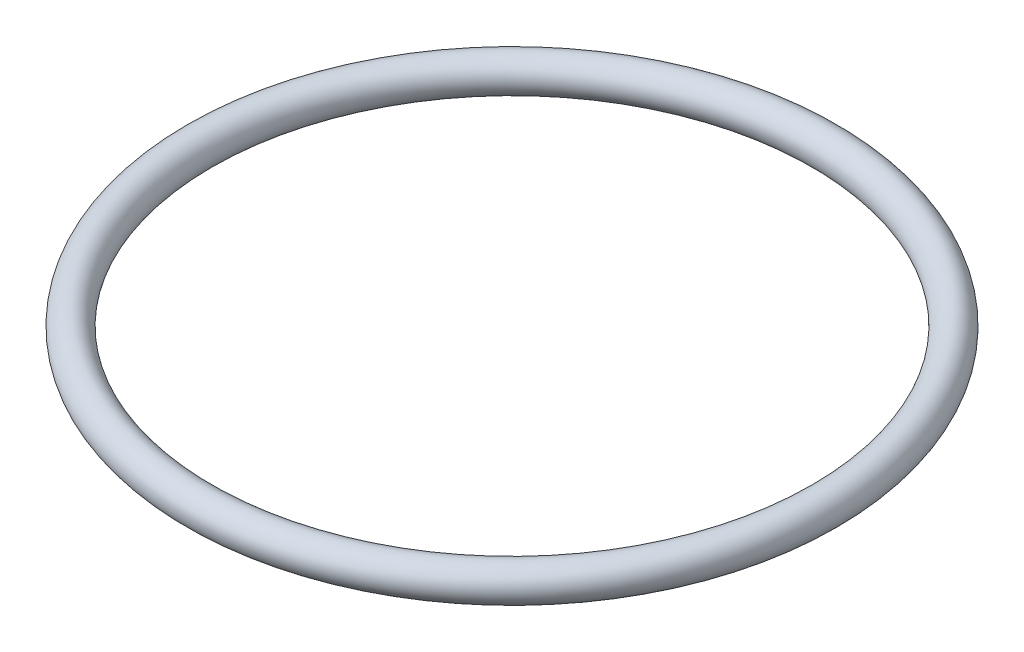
ISO-10303-21;
HEADER;
FILE_DESCRIPTION(('STEP AP214'),'2;1');
FILE_NAME('part.step','',(''),(''),'','','');
FILE_SCHEMA(('AUTOMOTIVE_DESIGN { 1 0 10303 214 1 1 1 1 }'));
ENDSEC;
DATA;
#1=APPLICATION_CONTEXT('core data for automotive mechanical design processes');
#2=APPLICATION_PROTOCOL_DEFINITION('international standard','automotive_design',2000,#1);
#3=PRODUCT_CONTEXT('',#1,'mechanical');
#4=PRODUCT('Part','Part','',(#3));
#5=PRODUCT_RELATED_PRODUCT_CATEGORY('part','',(#4));
#6=PRODUCT_DEFINITION_FORMATION('','',#4);
#7=PRODUCT_DEFINITION_CONTEXT('part definition',#1,'design');
#8=PRODUCT_DEFINITION('design','',#6,#7);
#9=PRODUCT_DEFINITION_SHAPE('','',#8);
#10=(LENGTH_UNIT() NAMED_UNIT(*) SI_UNIT(.MILLI.,.METRE.));
#11=(NAMED_UNIT(*) PLANE_ANGLE_UNIT() SI_UNIT($,.RADIAN.));
#12=(NAMED_UNIT(*) SI_UNIT($,.STERADIAN.) SOLID_ANGLE_UNIT());
#13=UNCERTAINTY_MEASURE_WITH_UNIT(LENGTH_MEASURE(1.E-05),#10,'distance_accuracy_value','');
#14=(GEOMETRIC_REPRESENTATION_CONTEXT(3) GLOBAL_UNCERTAINTY_ASSIGNED_CONTEXT((#13)) GLOBAL_UNIT_ASSIGNED_CONTEXT((#10,
#11,#12)) REPRESENTATION_CONTEXT('',''));
#15=CARTESIAN_POINT('',(0.,0.,0.));
#16=DIRECTION('',(0.,0.,1.));
#17=DIRECTION('',(1.,0.,0.));
#18=AXIS2_PLACEMENT_3D('',#15,#16,#17);
#19=CARTESIAN_POINT('',(0.,271.135,0.));
#20=DIRECTION('',(0.,-1.,0.));
#21=DIRECTION('',(1.,0.,0.));
#22=AXIS2_PLACEMENT_3D('',#19,#20,#21);
#23=TOROIDAL_SURFACE('',#22,31.725,1.76500000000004);
#24=CARTESIAN_POINT('',(33.49,271.135,0.));
#25=VERTEX_POINT('',#24);
#26=VERTEX_LOOP('',#25);
#27=FACE_BOUND('',#26,.T.);
#28=ADVANCED_FACE('F28',(#27),#23,.T.);
#29=CLOSED_SHELL('',(#28));
#30=MANIFOLD_SOLID_BREP('B2',#29);
#31=ADVANCED_BREP_SHAPE_REPRESENTATION('',(#18,#30),#14);
#32=SHAPE_DEFINITION_REPRESENTATION(#9,#31);
ENDSEC;
END-ISO-10303-21;
